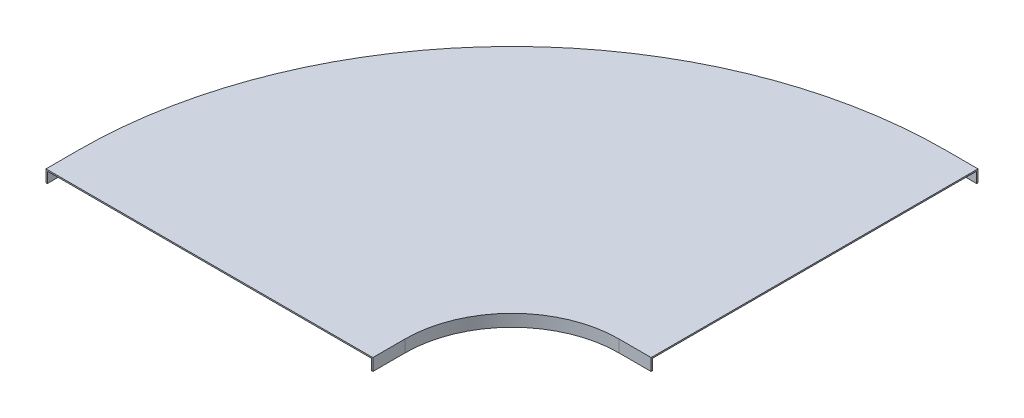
from build123d import *


with BuildPart() as part:
    # Sweep1: sweep along a path in Sketch1
    with BuildLine(Plane(origin=(0, 0, 0), x_dir=(1, 0, 0), z_dir=(0, 1, 0))) as sweep1_path:
        Line((130, 130), (100, 130))
        ThreePointArc((100, 130), (29.289321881, 100.710678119), (0, 30))
        Line((0, 30), (0, 0))
    # Sketch3 → Sweep1 (sweep)
    with BuildSketch(Plane.XY):
        Polygon((0, 0), (0, -10), (1.214, -10), (1.214, 1.214), (-301.214, 1.214), (-301.214, -10), (-300, -10), (-300, 0), align=None)
    sweep(path=sweep1_path.line)


solid = part.part
